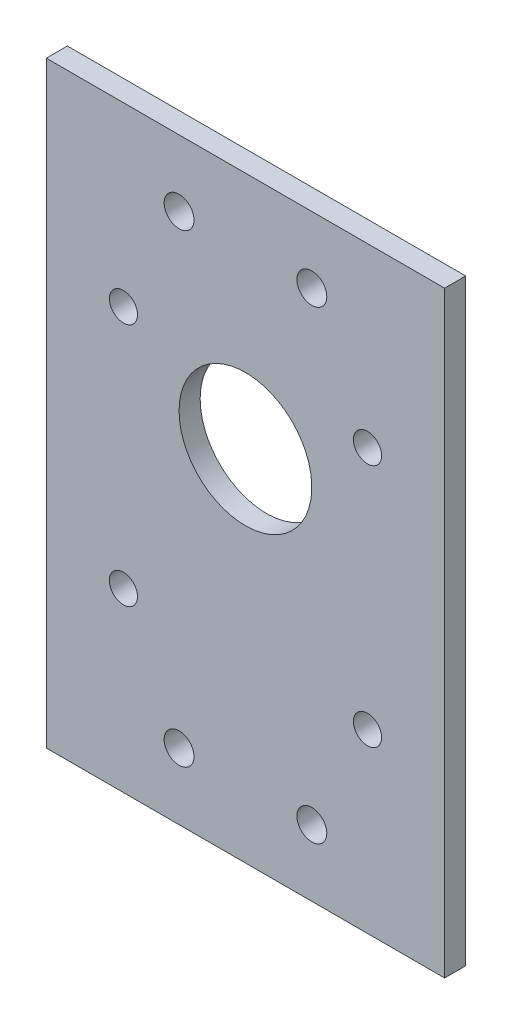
ISO-10303-21;
HEADER;
FILE_DESCRIPTION(('STEP AP214'),'2;1');
FILE_NAME('part.step','',(''),(''),'','','');
FILE_SCHEMA(('AUTOMOTIVE_DESIGN { 1 0 10303 214 1 1 1 1 }'));
ENDSEC;
DATA;
#1=APPLICATION_CONTEXT('core data for automotive mechanical design processes');
#2=APPLICATION_PROTOCOL_DEFINITION('international standard','automotive_design',2000,#1);
#3=PRODUCT_CONTEXT('',#1,'mechanical');
#4=PRODUCT('Part','Part','',(#3));
#5=PRODUCT_RELATED_PRODUCT_CATEGORY('part','',(#4));
#6=PRODUCT_DEFINITION_FORMATION('','',#4);
#7=PRODUCT_DEFINITION_CONTEXT('part definition',#1,'design');
#8=PRODUCT_DEFINITION('design','',#6,#7);
#9=PRODUCT_DEFINITION_SHAPE('','',#8);
#10=(LENGTH_UNIT() NAMED_UNIT(*) SI_UNIT(.MILLI.,.METRE.));
#11=(NAMED_UNIT(*) PLANE_ANGLE_UNIT() SI_UNIT($,.RADIAN.));
#12=(NAMED_UNIT(*) SI_UNIT($,.STERADIAN.) SOLID_ANGLE_UNIT());
#13=UNCERTAINTY_MEASURE_WITH_UNIT(LENGTH_MEASURE(1.E-05),#10,'distance_accuracy_value','');
#14=(GEOMETRIC_REPRESENTATION_CONTEXT(3) GLOBAL_UNCERTAINTY_ASSIGNED_CONTEXT((#13)) GLOBAL_UNIT_ASSIGNED_CONTEXT((#10,
#11,#12)) REPRESENTATION_CONTEXT('',''));
#15=CARTESIAN_POINT('',(0.,0.,0.));
#16=DIRECTION('',(0.,0.,1.));
#17=DIRECTION('',(1.,0.,0.));
#18=AXIS2_PLACEMENT_3D('',#15,#16,#17);
#19=CARTESIAN_POINT('',(-60.,90.,3.175));
#20=DIRECTION('',(0.,-1.,0.));
#21=DIRECTION('',(1.,0.,0.));
#22=AXIS2_PLACEMENT_3D('',#19,#20,#21);
#23=PLANE('',#22);
#24=DIRECTION('',(-1.,0.,0.));
#25=VECTOR('',#24,1.);
#26=CARTESIAN_POINT('',(-60.,90.,-3.175));
#27=LINE('',#26,#25);
#28=CARTESIAN_POINT('',(60.,90.,-3.175));
#29=VERTEX_POINT('',#28);
#30=CARTESIAN_POINT('',(-60.,90.,-3.175));
#31=VERTEX_POINT('',#30);
#32=EDGE_CURVE('E105',#29,#31,#27,.T.);
#33=ORIENTED_EDGE('',*,*,#32,.T.);
#34=DIRECTION('',(0.,0.,-1.));
#35=VECTOR('',#34,1.);
#36=CARTESIAN_POINT('',(-60.,90.,3.175));
#37=LINE('',#36,#35);
#38=CARTESIAN_POINT('',(-60.,90.,3.175));
#39=VERTEX_POINT('',#38);
#40=EDGE_CURVE('E11',#39,#31,#37,.T.);
#41=ORIENTED_EDGE('',*,*,#40,.F.);
#42=DIRECTION('',(-1.,0.,0.));
#43=VECTOR('',#42,1.);
#44=CARTESIAN_POINT('',(-60.,90.,3.175));
#45=LINE('',#44,#43);
#46=CARTESIAN_POINT('',(60.,90.,3.175));
#47=VERTEX_POINT('',#46);
#48=EDGE_CURVE('E89',#47,#39,#45,.T.);
#49=ORIENTED_EDGE('',*,*,#48,.F.);
#50=DIRECTION('',(0.,0.,-1.));
#51=VECTOR('',#50,1.);
#52=CARTESIAN_POINT('',(60.,90.,3.175));
#53=LINE('',#52,#51);
#54=EDGE_CURVE('E98',#47,#29,#53,.T.);
#55=ORIENTED_EDGE('',*,*,#54,.T.);
#56=EDGE_LOOP('',(#33,#41,#49,#55));
#57=FACE_BOUND('',#56,.T.);
#58=ADVANCED_FACE('F39',(#57),#23,.F.);
#59=CARTESIAN_POINT('',(-60.,-90.,3.175));
#60=DIRECTION('',(1.,0.,0.));
#61=DIRECTION('',(0.,0.,-1.));
#62=AXIS2_PLACEMENT_3D('',#59,#60,#61);
#63=PLANE('',#62);
#64=DIRECTION('',(0.,-1.,0.));
#65=VECTOR('',#64,1.);
#66=CARTESIAN_POINT('',(-60.,-90.,-3.175));
#67=LINE('',#66,#65);
#68=CARTESIAN_POINT('',(-60.,-90.,-3.175));
#69=VERTEX_POINT('',#68);
#70=EDGE_CURVE('E94',#31,#69,#67,.T.);
#71=ORIENTED_EDGE('',*,*,#70,.T.);
#72=DIRECTION('',(0.,0.,-1.));
#73=VECTOR('',#72,1.);
#74=CARTESIAN_POINT('',(-60.,-90.,3.175));
#75=LINE('',#74,#73);
#76=CARTESIAN_POINT('',(-60.,-90.,3.175));
#77=VERTEX_POINT('',#76);
#78=EDGE_CURVE('E50',#77,#69,#75,.T.);
#79=ORIENTED_EDGE('',*,*,#78,.F.);
#80=DIRECTION('',(0.,-1.,0.));
#81=VECTOR('',#80,1.);
#82=CARTESIAN_POINT('',(-60.,-90.,3.175));
#83=LINE('',#82,#81);
#84=EDGE_CURVE('E83',#39,#77,#83,.T.);
#85=ORIENTED_EDGE('',*,*,#84,.F.);
#86=ORIENTED_EDGE('',*,*,#40,.T.);
#87=EDGE_LOOP('',(#71,#79,#85,#86));
#88=FACE_BOUND('',#87,.T.);
#89=ADVANCED_FACE('F91',(#88),#63,.F.);
#90=CARTESIAN_POINT('',(-60.,-90.,3.175));
#91=DIRECTION('',(0.,1.,0.));
#92=DIRECTION('',(0.,0.,1.));
#93=AXIS2_PLACEMENT_3D('',#90,#91,#92);
#94=PLANE('',#93);
#95=DIRECTION('',(1.,0.,0.));
#96=VECTOR('',#95,1.);
#97=CARTESIAN_POINT('',(-60.,-90.,-3.175));
#98=LINE('',#97,#96);
#99=CARTESIAN_POINT('',(60.,-90.,-3.175));
#100=VERTEX_POINT('',#99);
#101=EDGE_CURVE('E75',#69,#100,#98,.T.);
#102=ORIENTED_EDGE('',*,*,#101,.T.);
#103=DIRECTION('',(0.,0.,-1.));
#104=VECTOR('',#103,1.);
#105=CARTESIAN_POINT('',(60.,-90.,3.175));
#106=LINE('',#105,#104);
#107=CARTESIAN_POINT('',(60.,-90.,3.175));
#108=VERTEX_POINT('',#107);
#109=EDGE_CURVE('E92',#108,#100,#106,.T.);
#110=ORIENTED_EDGE('',*,*,#109,.F.);
#111=DIRECTION('',(1.,0.,0.));
#112=VECTOR('',#111,1.);
#113=CARTESIAN_POINT('',(-60.,-90.,3.175));
#114=LINE('',#113,#112);
#115=EDGE_CURVE('E86',#77,#108,#114,.T.);
#116=ORIENTED_EDGE('',*,*,#115,.F.);
#117=ORIENTED_EDGE('',*,*,#78,.T.);
#118=EDGE_LOOP('',(#102,#110,#116,#117));
#119=FACE_BOUND('',#118,.T.);
#120=ADVANCED_FACE('F96',(#119),#94,.F.);
#121=CARTESIAN_POINT('',(60.,-90.,3.175));
#122=DIRECTION('',(-1.,0.,0.));
#123=DIRECTION('',(0.,0.,1.));
#124=AXIS2_PLACEMENT_3D('',#121,#122,#123);
#125=PLANE('',#124);
#126=DIRECTION('',(0.,1.,0.));
#127=VECTOR('',#126,1.);
#128=CARTESIAN_POINT('',(60.,-90.,-3.175));
#129=LINE('',#128,#127);
#130=EDGE_CURVE('E77',#100,#29,#129,.T.);
#131=ORIENTED_EDGE('',*,*,#130,.T.);
#132=ORIENTED_EDGE('',*,*,#54,.F.);
#133=DIRECTION('',(0.,1.,0.));
#134=VECTOR('',#133,1.);
#135=CARTESIAN_POINT('',(60.,-90.,3.175));
#136=LINE('',#135,#134);
#137=EDGE_CURVE('E54',#108,#47,#136,.T.);
#138=ORIENTED_EDGE('',*,*,#137,.F.);
#139=ORIENTED_EDGE('',*,*,#109,.T.);
#140=EDGE_LOOP('',(#131,#132,#138,#139));
#141=FACE_BOUND('',#140,.T.);
#142=ADVANCED_FACE('F109',(#141),#125,.F.);
#143=CARTESIAN_POINT('',(0.,0.,3.175));
#144=DIRECTION('',(0.,0.,1.));
#145=DIRECTION('',(1.,0.,0.));
#146=AXIS2_PLACEMENT_3D('',#143,#144,#145);
#147=PLANE('',#146);
#148=CARTESIAN_POINT('',(0.000447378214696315,17.9995526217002,3.175));
#149=DIRECTION('',(0.,0.,-1.));
#150=DIRECTION('',(-1.,0.,0.));
#151=AXIS2_PLACEMENT_3D('',#148,#149,#150);
#152=CIRCLE('',#151,20.);
#153=CARTESIAN_POINT('',(-19.9995526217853,17.9995526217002,3.175));
#154=VERTEX_POINT('',#153);
#155=EDGE_CURVE('E147',#154,#154,#152,.T.);
#156=ORIENTED_EDGE('',*,*,#155,.T.);
#157=EDGE_LOOP('',(#156));
#158=FACE_BOUND('',#157,.T.);
#159=CARTESIAN_POINT('',(-20.,-70.,3.175));
#160=DIRECTION('',(0.,0.,1.));
#161=DIRECTION('',(1.,0.,0.));
#162=AXIS2_PLACEMENT_3D('',#159,#160,#161);
#163=CIRCLE('',#162,4.50000000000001);
#164=CARTESIAN_POINT('',(-15.5,-70.,3.175));
#165=VERTEX_POINT('',#164);
#166=EDGE_CURVE('E149',#165,#165,#163,.T.);
#167=ORIENTED_EDGE('',*,*,#166,.F.);
#168=EDGE_LOOP('',(#167));
#169=FACE_BOUND('',#168,.T.);
#170=CARTESIAN_POINT('',(20.,-70.,3.175));
#171=DIRECTION('',(0.,0.,1.));
#172=DIRECTION('',(1.,0.,0.));
#173=AXIS2_PLACEMENT_3D('',#170,#171,#172);
#174=CIRCLE('',#173,4.50000000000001);
#175=CARTESIAN_POINT('',(24.5,-70.,3.175));
#176=VERTEX_POINT('',#175);
#177=EDGE_CURVE('E156',#176,#176,#174,.T.);
#178=ORIENTED_EDGE('',*,*,#177,.F.);
#179=EDGE_LOOP('',(#178));
#180=FACE_BOUND('',#179,.T.);
#181=CARTESIAN_POINT('',(20.,70.,3.175));
#182=DIRECTION('',(0.,0.,1.));
#183=DIRECTION('',(1.,0.,0.));
#184=AXIS2_PLACEMENT_3D('',#181,#182,#183);
#185=CIRCLE('',#184,4.50000000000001);
#186=CARTESIAN_POINT('',(24.5,70.,3.175));
#187=VERTEX_POINT('',#186);
#188=EDGE_CURVE('E141',#187,#187,#185,.T.);
#189=ORIENTED_EDGE('',*,*,#188,.F.);
#190=EDGE_LOOP('',(#189));
#191=FACE_BOUND('',#190,.T.);
#192=CARTESIAN_POINT('',(-20.,70.,3.175));
#193=DIRECTION('',(0.,0.,1.));
#194=DIRECTION('',(1.,0.,0.));
#195=AXIS2_PLACEMENT_3D('',#192,#193,#194);
#196=CIRCLE('',#195,4.50000000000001);
#197=CARTESIAN_POINT('',(-15.5,70.,3.175));
#198=VERTEX_POINT('',#197);
#199=EDGE_CURVE('E138',#198,#198,#196,.T.);
#200=ORIENTED_EDGE('',*,*,#199,.F.);
#201=EDGE_LOOP('',(#200));
#202=FACE_BOUND('',#201,.T.);
#203=CARTESIAN_POINT('',(-36.7699999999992,-36.77,3.175));
#204=DIRECTION('',(0.,0.,1.));
#205=DIRECTION('',(1.,0.,0.));
#206=AXIS2_PLACEMENT_3D('',#203,#204,#205);
#207=CIRCLE('',#206,4.25);
#208=CARTESIAN_POINT('',(-32.5199999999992,-36.77,3.175));
#209=VERTEX_POINT('',#208);
#210=EDGE_CURVE('E123',#209,#209,#207,.T.);
#211=ORIENTED_EDGE('',*,*,#210,.F.);
#212=EDGE_LOOP('',(#211));
#213=FACE_BOUND('',#212,.T.);
#214=CARTESIAN_POINT('',(36.7700000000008,-36.77,3.175));
#215=DIRECTION('',(0.,0.,1.));
#216=DIRECTION('',(1.,0.,0.));
#217=AXIS2_PLACEMENT_3D('',#214,#215,#216);
#218=CIRCLE('',#217,4.25);
#219=CARTESIAN_POINT('',(41.0200000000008,-36.77,3.175));
#220=VERTEX_POINT('',#219);
#221=EDGE_CURVE('E134',#220,#220,#218,.T.);
#222=ORIENTED_EDGE('',*,*,#221,.F.);
#223=EDGE_LOOP('',(#222));
#224=FACE_BOUND('',#223,.T.);
#225=CARTESIAN_POINT('',(36.77,36.77,3.175));
#226=DIRECTION('',(0.,0.,1.));
#227=DIRECTION('',(1.,0.,0.));
#228=AXIS2_PLACEMENT_3D('',#225,#226,#227);
#229=CIRCLE('',#228,4.25);
#230=CARTESIAN_POINT('',(41.02,36.77,3.175));
#231=VERTEX_POINT('',#230);
#232=EDGE_CURVE('E120',#231,#231,#229,.T.);
#233=ORIENTED_EDGE('',*,*,#232,.F.);
#234=EDGE_LOOP('',(#233));
#235=FACE_BOUND('',#234,.T.);
#236=CARTESIAN_POINT('',(-36.77,36.77,3.175));
#237=DIRECTION('',(0.,0.,1.));
#238=DIRECTION('',(1.,0.,0.));
#239=AXIS2_PLACEMENT_3D('',#236,#237,#238);
#240=CIRCLE('',#239,4.25);
#241=CARTESIAN_POINT('',(-32.52,36.77,3.175));
#242=VERTEX_POINT('',#241);
#243=EDGE_CURVE('E118',#242,#242,#240,.T.);
#244=ORIENTED_EDGE('',*,*,#243,.F.);
#245=EDGE_LOOP('',(#244));
#246=FACE_BOUND('',#245,.T.);
#247=ORIENTED_EDGE('',*,*,#48,.T.);
#248=ORIENTED_EDGE('',*,*,#84,.T.);
#249=ORIENTED_EDGE('',*,*,#115,.T.);
#250=ORIENTED_EDGE('',*,*,#137,.T.);
#251=EDGE_LOOP('',(#247,#248,#249,#250));
#252=FACE_BOUND('',#251,.T.);
#253=ADVANCED_FACE('F88',(#158,#169,#180,#191,#202,#213,#224,#235,#246,#252),#147,.T.);
#254=CARTESIAN_POINT('',(0.,0.,-3.175));
#255=DIRECTION('',(0.,0.,1.));
#256=DIRECTION('',(1.,0.,0.));
#257=AXIS2_PLACEMENT_3D('',#254,#255,#256);
#258=PLANE('',#257);
#259=CARTESIAN_POINT('',(0.000447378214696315,17.9995526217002,-3.175));
#260=DIRECTION('',(0.,0.,-1.));
#261=DIRECTION('',(-1.,0.,0.));
#262=AXIS2_PLACEMENT_3D('',#259,#260,#261);
#263=CIRCLE('',#262,20.);
#264=CARTESIAN_POINT('',(-19.9995526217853,17.9995526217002,-3.175));
#265=VERTEX_POINT('',#264);
#266=EDGE_CURVE('E163',#265,#265,#263,.T.);
#267=ORIENTED_EDGE('',*,*,#266,.F.);
#268=EDGE_LOOP('',(#267));
#269=FACE_BOUND('',#268,.T.);
#270=CARTESIAN_POINT('',(-20.,-70.,-3.175));
#271=DIRECTION('',(0.,0.,1.));
#272=DIRECTION('',(1.,0.,0.));
#273=AXIS2_PLACEMENT_3D('',#270,#271,#272);
#274=CIRCLE('',#273,4.50000000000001);
#275=CARTESIAN_POINT('',(-15.5,-70.,-3.175));
#276=VERTEX_POINT('',#275);
#277=EDGE_CURVE('E148',#276,#276,#274,.T.);
#278=ORIENTED_EDGE('',*,*,#277,.T.);
#279=EDGE_LOOP('',(#278));
#280=FACE_BOUND('',#279,.T.);
#281=CARTESIAN_POINT('',(20.,-70.,-3.175));
#282=DIRECTION('',(0.,0.,1.));
#283=DIRECTION('',(1.,0.,0.));
#284=AXIS2_PLACEMENT_3D('',#281,#282,#283);
#285=CIRCLE('',#284,4.50000000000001);
#286=CARTESIAN_POINT('',(24.5,-70.,-3.175));
#287=VERTEX_POINT('',#286);
#288=EDGE_CURVE('E153',#287,#287,#285,.T.);
#289=ORIENTED_EDGE('',*,*,#288,.T.);
#290=EDGE_LOOP('',(#289));
#291=FACE_BOUND('',#290,.T.);
#292=CARTESIAN_POINT('',(20.,70.,-3.175));
#293=DIRECTION('',(0.,0.,1.));
#294=DIRECTION('',(1.,0.,0.));
#295=AXIS2_PLACEMENT_3D('',#292,#293,#294);
#296=CIRCLE('',#295,4.50000000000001);
#297=CARTESIAN_POINT('',(24.5,70.,-3.175));
#298=VERTEX_POINT('',#297);
#299=EDGE_CURVE('E157',#298,#298,#296,.T.);
#300=ORIENTED_EDGE('',*,*,#299,.T.);
#301=EDGE_LOOP('',(#300));
#302=FACE_BOUND('',#301,.T.);
#303=CARTESIAN_POINT('',(-20.,70.,-3.175));
#304=DIRECTION('',(0.,0.,1.));
#305=DIRECTION('',(1.,0.,0.));
#306=AXIS2_PLACEMENT_3D('',#303,#304,#305);
#307=CIRCLE('',#306,4.50000000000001);
#308=CARTESIAN_POINT('',(-15.5,70.,-3.175));
#309=VERTEX_POINT('',#308);
#310=EDGE_CURVE('E127',#309,#309,#307,.T.);
#311=ORIENTED_EDGE('',*,*,#310,.T.);
#312=EDGE_LOOP('',(#311));
#313=FACE_BOUND('',#312,.T.);
#314=CARTESIAN_POINT('',(-36.7699999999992,-36.77,-3.175));
#315=DIRECTION('',(0.,0.,1.));
#316=DIRECTION('',(1.,0.,0.));
#317=AXIS2_PLACEMENT_3D('',#314,#315,#316);
#318=CIRCLE('',#317,4.25);
#319=CARTESIAN_POINT('',(-32.5199999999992,-36.77,-3.175));
#320=VERTEX_POINT('',#319);
#321=EDGE_CURVE('E125',#320,#320,#318,.T.);
#322=ORIENTED_EDGE('',*,*,#321,.T.);
#323=EDGE_LOOP('',(#322));
#324=FACE_BOUND('',#323,.T.);
#325=CARTESIAN_POINT('',(36.7700000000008,-36.77,-3.175));
#326=DIRECTION('',(0.,0.,1.));
#327=DIRECTION('',(1.,0.,0.));
#328=AXIS2_PLACEMENT_3D('',#325,#326,#327);
#329=CIRCLE('',#328,4.25);
#330=CARTESIAN_POINT('',(41.0200000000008,-36.77,-3.175));
#331=VERTEX_POINT('',#330);
#332=EDGE_CURVE('E129',#331,#331,#329,.T.);
#333=ORIENTED_EDGE('',*,*,#332,.T.);
#334=EDGE_LOOP('',(#333));
#335=FACE_BOUND('',#334,.T.);
#336=CARTESIAN_POINT('',(36.77,36.77,-3.175));
#337=DIRECTION('',(0.,0.,1.));
#338=DIRECTION('',(1.,0.,0.));
#339=AXIS2_PLACEMENT_3D('',#336,#337,#338);
#340=CIRCLE('',#339,4.25);
#341=CARTESIAN_POINT('',(41.02,36.77,-3.175));
#342=VERTEX_POINT('',#341);
#343=EDGE_CURVE('E131',#342,#342,#340,.T.);
#344=ORIENTED_EDGE('',*,*,#343,.T.);
#345=EDGE_LOOP('',(#344));
#346=FACE_BOUND('',#345,.T.);
#347=CARTESIAN_POINT('',(-36.77,36.77,-3.175));
#348=DIRECTION('',(0.,0.,1.));
#349=DIRECTION('',(1.,0.,0.));
#350=AXIS2_PLACEMENT_3D('',#347,#348,#349);
#351=CIRCLE('',#350,4.25);
#352=CARTESIAN_POINT('',(-32.52,36.77,-3.175));
#353=VERTEX_POINT('',#352);
#354=EDGE_CURVE('E104',#353,#353,#351,.T.);
#355=ORIENTED_EDGE('',*,*,#354,.T.);
#356=EDGE_LOOP('',(#355));
#357=FACE_BOUND('',#356,.T.);
#358=ORIENTED_EDGE('',*,*,#32,.F.);
#359=ORIENTED_EDGE('',*,*,#130,.F.);
#360=ORIENTED_EDGE('',*,*,#101,.F.);
#361=ORIENTED_EDGE('',*,*,#70,.F.);
#362=EDGE_LOOP('',(#358,#359,#360,#361));
#363=FACE_BOUND('',#362,.T.);
#364=ADVANCED_FACE('F114',(#269,#280,#291,#302,#313,#324,#335,#346,#357,#363),#258,.F.);
#365=CARTESIAN_POINT('',(-36.77,36.77,-3.175));
#366=DIRECTION('',(0.,0.,1.));
#367=DIRECTION('',(1.,0.,0.));
#368=AXIS2_PLACEMENT_3D('',#365,#366,#367);
#369=CYLINDRICAL_SURFACE('',#368,4.25);
#370=ORIENTED_EDGE('',*,*,#354,.F.);
#371=EDGE_LOOP('',(#370));
#372=FACE_BOUND('',#371,.T.);
#373=ORIENTED_EDGE('',*,*,#243,.T.);
#374=EDGE_LOOP('',(#373));
#375=FACE_BOUND('',#374,.T.);
#376=ADVANCED_FACE('F182',(#372,#375),#369,.F.);
#377=CARTESIAN_POINT('',(36.77,36.77,-3.175));
#378=DIRECTION('',(0.,0.,1.));
#379=DIRECTION('',(1.,0.,0.));
#380=AXIS2_PLACEMENT_3D('',#377,#378,#379);
#381=CYLINDRICAL_SURFACE('',#380,4.25);
#382=ORIENTED_EDGE('',*,*,#343,.F.);
#383=EDGE_LOOP('',(#382));
#384=FACE_BOUND('',#383,.T.);
#385=ORIENTED_EDGE('',*,*,#232,.T.);
#386=EDGE_LOOP('',(#385));
#387=FACE_BOUND('',#386,.T.);
#388=ADVANCED_FACE('F203',(#384,#387),#381,.F.);
#389=CARTESIAN_POINT('',(36.7700000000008,-36.77,-3.175));
#390=DIRECTION('',(0.,0.,1.));
#391=DIRECTION('',(1.,0.,0.));
#392=AXIS2_PLACEMENT_3D('',#389,#390,#391);
#393=CYLINDRICAL_SURFACE('',#392,4.25);
#394=ORIENTED_EDGE('',*,*,#332,.F.);
#395=EDGE_LOOP('',(#394));
#396=FACE_BOUND('',#395,.T.);
#397=ORIENTED_EDGE('',*,*,#221,.T.);
#398=EDGE_LOOP('',(#397));
#399=FACE_BOUND('',#398,.T.);
#400=ADVANCED_FACE('F238',(#396,#399),#393,.F.);
#401=CARTESIAN_POINT('',(-36.7699999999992,-36.77,-3.175));
#402=DIRECTION('',(0.,0.,1.));
#403=DIRECTION('',(1.,0.,0.));
#404=AXIS2_PLACEMENT_3D('',#401,#402,#403);
#405=CYLINDRICAL_SURFACE('',#404,4.25);
#406=ORIENTED_EDGE('',*,*,#321,.F.);
#407=EDGE_LOOP('',(#406));
#408=FACE_BOUND('',#407,.T.);
#409=ORIENTED_EDGE('',*,*,#210,.T.);
#410=EDGE_LOOP('',(#409));
#411=FACE_BOUND('',#410,.T.);
#412=ADVANCED_FACE('F246',(#408,#411),#405,.F.);
#413=CARTESIAN_POINT('',(-20.,70.,-3.175));
#414=DIRECTION('',(0.,0.,1.));
#415=DIRECTION('',(1.,0.,0.));
#416=AXIS2_PLACEMENT_3D('',#413,#414,#415);
#417=CYLINDRICAL_SURFACE('',#416,4.50000000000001);
#418=ORIENTED_EDGE('',*,*,#310,.F.);
#419=EDGE_LOOP('',(#418));
#420=FACE_BOUND('',#419,.T.);
#421=ORIENTED_EDGE('',*,*,#199,.T.);
#422=EDGE_LOOP('',(#421));
#423=FACE_BOUND('',#422,.T.);
#424=ADVANCED_FACE('F256',(#420,#423),#417,.F.);
#425=CARTESIAN_POINT('',(20.,70.,-3.175));
#426=DIRECTION('',(0.,0.,1.));
#427=DIRECTION('',(1.,0.,0.));
#428=AXIS2_PLACEMENT_3D('',#425,#426,#427);
#429=CYLINDRICAL_SURFACE('',#428,4.50000000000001);
#430=ORIENTED_EDGE('',*,*,#299,.F.);
#431=EDGE_LOOP('',(#430));
#432=FACE_BOUND('',#431,.T.);
#433=ORIENTED_EDGE('',*,*,#188,.T.);
#434=EDGE_LOOP('',(#433));
#435=FACE_BOUND('',#434,.T.);
#436=ADVANCED_FACE('F270',(#432,#435),#429,.F.);
#437=CARTESIAN_POINT('',(20.,-70.,-3.175));
#438=DIRECTION('',(0.,0.,1.));
#439=DIRECTION('',(1.,0.,0.));
#440=AXIS2_PLACEMENT_3D('',#437,#438,#439);
#441=CYLINDRICAL_SURFACE('',#440,4.50000000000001);
#442=ORIENTED_EDGE('',*,*,#288,.F.);
#443=EDGE_LOOP('',(#442));
#444=FACE_BOUND('',#443,.T.);
#445=ORIENTED_EDGE('',*,*,#177,.T.);
#446=EDGE_LOOP('',(#445));
#447=FACE_BOUND('',#446,.T.);
#448=ADVANCED_FACE('F277',(#444,#447),#441,.F.);
#449=CARTESIAN_POINT('',(-20.,-70.,-3.175));
#450=DIRECTION('',(0.,0.,1.));
#451=DIRECTION('',(1.,0.,0.));
#452=AXIS2_PLACEMENT_3D('',#449,#450,#451);
#453=CYLINDRICAL_SURFACE('',#452,4.50000000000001);
#454=ORIENTED_EDGE('',*,*,#277,.F.);
#455=EDGE_LOOP('',(#454));
#456=FACE_BOUND('',#455,.T.);
#457=ORIENTED_EDGE('',*,*,#166,.T.);
#458=EDGE_LOOP('',(#457));
#459=FACE_BOUND('',#458,.T.);
#460=ADVANCED_FACE('F171',(#456,#459),#453,.F.);
#461=CARTESIAN_POINT('',(0.000447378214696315,17.9995526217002,3.175));
#462=DIRECTION('',(0.,0.,-1.));
#463=DIRECTION('',(-1.,0.,0.));
#464=AXIS2_PLACEMENT_3D('',#461,#462,#463);
#465=CYLINDRICAL_SURFACE('',#464,20.);
#466=ORIENTED_EDGE('',*,*,#155,.F.);
#467=EDGE_LOOP('',(#466));
#468=FACE_BOUND('',#467,.T.);
#469=ORIENTED_EDGE('',*,*,#266,.T.);
#470=EDGE_LOOP('',(#469));
#471=FACE_BOUND('',#470,.T.);
#472=ADVANCED_FACE('F174',(#468,#471),#465,.F.);
#473=CLOSED_SHELL('',(#58,#89,#120,#142,#253,#364,#376,#388,#400,#412,#424,#436,#448,#460,#472));
#474=MANIFOLD_SOLID_BREP('B2',#473);
#475=ADVANCED_BREP_SHAPE_REPRESENTATION('',(#18,#474),#14);
#476=SHAPE_DEFINITION_REPRESENTATION(#9,#475);
ENDSEC;
END-ISO-10303-21;
